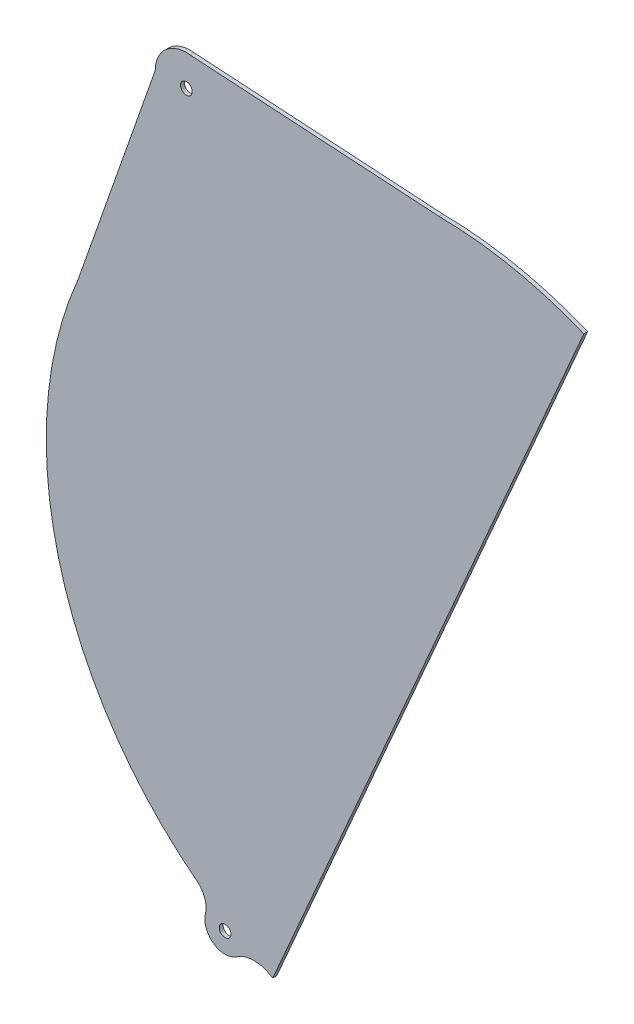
ISO-10303-21;
HEADER;
FILE_DESCRIPTION(('STEP AP214'),'2;1');
FILE_NAME('part.step','',(''),(''),'','','');
FILE_SCHEMA(('AUTOMOTIVE_DESIGN { 1 0 10303 214 1 1 1 1 }'));
ENDSEC;
DATA;
#1=APPLICATION_CONTEXT('core data for automotive mechanical design processes');
#2=APPLICATION_PROTOCOL_DEFINITION('international standard','automotive_design',2000,#1);
#3=PRODUCT_CONTEXT('',#1,'mechanical');
#4=PRODUCT('Part','Part','',(#3));
#5=PRODUCT_RELATED_PRODUCT_CATEGORY('part','',(#4));
#6=PRODUCT_DEFINITION_FORMATION('','',#4);
#7=PRODUCT_DEFINITION_CONTEXT('part definition',#1,'design');
#8=PRODUCT_DEFINITION('design','',#6,#7);
#9=PRODUCT_DEFINITION_SHAPE('','',#8);
#10=(LENGTH_UNIT() NAMED_UNIT(*) SI_UNIT(.MILLI.,.METRE.));
#11=(NAMED_UNIT(*) PLANE_ANGLE_UNIT() SI_UNIT($,.RADIAN.));
#12=(NAMED_UNIT(*) SI_UNIT($,.STERADIAN.) SOLID_ANGLE_UNIT());
#13=UNCERTAINTY_MEASURE_WITH_UNIT(LENGTH_MEASURE(1.E-05),#10,'distance_accuracy_value','');
#14=(GEOMETRIC_REPRESENTATION_CONTEXT(3) GLOBAL_UNCERTAINTY_ASSIGNED_CONTEXT((#13)) GLOBAL_UNIT_ASSIGNED_CONTEXT((#10,
#11,#12)) REPRESENTATION_CONTEXT('',''));
#15=CARTESIAN_POINT('',(0.,0.,0.));
#16=DIRECTION('',(0.,0.,1.));
#17=DIRECTION('',(1.,0.,0.));
#18=AXIS2_PLACEMENT_3D('',#15,#16,#17);
#19=CARTESIAN_POINT('',(0.,0.,3.175));
#20=DIRECTION('',(0.,0.,1.));
#21=DIRECTION('',(1.,0.,0.));
#22=AXIS2_PLACEMENT_3D('',#19,#20,#21);
#23=PLANE('',#22);
#24=CARTESIAN_POINT('',(-203.2,304.8,3.175));
#25=DIRECTION('',(0.,0.,1.));
#26=DIRECTION('',(1.,0.,0.));
#27=AXIS2_PLACEMENT_3D('',#24,#25,#26);
#28=CIRCLE('',#27,4.76250000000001);
#29=CARTESIAN_POINT('',(-198.4375,304.8,3.175));
#30=VERTEX_POINT('',#29);
#31=EDGE_CURVE('E238',#30,#30,#28,.T.);
#32=ORIENTED_EDGE('',*,*,#31,.F.);
#33=EDGE_LOOP('',(#32));
#34=FACE_BOUND('',#33,.T.);
#35=CARTESIAN_POINT('',(-171.614353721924,-274.640375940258,3.175));
#36=DIRECTION('',(0.,0.,1.));
#37=DIRECTION('',(1.,0.,0.));
#38=AXIS2_PLACEMENT_3D('',#35,#36,#37);
#39=CIRCLE('',#38,4.76250000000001);
#40=CARTESIAN_POINT('',(-166.851853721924,-274.640375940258,3.175));
#41=VERTEX_POINT('',#40);
#42=EDGE_CURVE('E168',#41,#41,#39,.T.);
#43=ORIENTED_EDGE('',*,*,#42,.F.);
#44=EDGE_LOOP('',(#43));
#45=FACE_BOUND('',#44,.T.);
#46=CARTESIAN_POINT('',(0.,0.,3.175));
#47=DIRECTION('',(0.,0.,1.));
#48=DIRECTION('',(1.,0.,0.));
#49=AXIS2_PLACEMENT_3D('',#46,#47,#48);
#50=CIRCLE('',#49,317.5);
#51=CARTESIAN_POINT('',(-134.867290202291,-287.431842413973,3.175));
#52=VERTEX_POINT('',#51);
#53=CARTESIAN_POINT('',(-132.685161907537,-288.445658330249,3.175));
#54=VERTEX_POINT('',#53);
#55=EDGE_CURVE('E157',#52,#54,#50,.T.);
#56=ORIENTED_EDGE('',*,*,#55,.T.);
#57=DIRECTION('',(-0.399652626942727,-0.916666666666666,0.));
#58=VECTOR('',#57,1.);
#59=CARTESIAN_POINT('',(121.068875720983,293.579460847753,3.175));
#60=LINE('',#59,#58);
#61=CARTESIAN_POINT('',(121.04349524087,293.521246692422,3.175));
#62=VERTEX_POINT('',#61);
#63=EDGE_CURVE('E56',#62,#54,#60,.T.);
#64=ORIENTED_EDGE('',*,*,#63,.F.);
#65=CARTESIAN_POINT('',(0.,0.,3.175));
#66=DIRECTION('',(0.,0.,1.));
#67=DIRECTION('',(1.,0.,0.));
#68=AXIS2_PLACEMENT_3D('',#65,#66,#67);
#69=CIRCLE('',#68,317.5);
#70=CARTESIAN_POINT('',(2.99071399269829,317.485914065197,3.175));
#71=VERTEX_POINT('',#70);
#72=EDGE_CURVE('E111',#62,#71,#69,.T.);
#73=ORIENTED_EDGE('',*,*,#72,.T.);
#74=DIRECTION('',(-0.99810431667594,0.0615448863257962,0.));
#75=VECTOR('',#74,1.);
#76=CARTESIAN_POINT('',(-200.079446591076,330.007581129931,3.175));
#77=LINE('',#76,#75);
#78=CARTESIAN_POINT('',(-200.079446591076,330.007581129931,3.175));
#79=VERTEX_POINT('',#78);
#80=EDGE_CURVE('E208',#71,#79,#77,.T.);
#81=ORIENTED_EDGE('',*,*,#80,.T.);
#82=CARTESIAN_POINT('',(-203.2,304.8,3.175));
#83=DIRECTION('',(0.,0.,1.));
#84=DIRECTION('',(1.,0.,0.));
#85=AXIS2_PLACEMENT_3D('',#82,#83,#84);
#86=CIRCLE('',#85,25.4);
#87=CARTESIAN_POINT('',(-228.6,304.8,3.175));
#88=VERTEX_POINT('',#87);
#89=EDGE_CURVE('E227',#79,#88,#86,.T.);
#90=ORIENTED_EDGE('',*,*,#89,.T.);
#91=DIRECTION('',(-0.331375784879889,-0.943498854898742,0.));
#92=VECTOR('',#91,1.);
#93=CARTESIAN_POINT('',(-228.6,304.8,3.175));
#94=LINE('',#93,#92);
#95=CARTESIAN_POINT('',(-291.270360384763,126.363868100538,3.175));
#96=VERTEX_POINT('',#95);
#97=EDGE_CURVE('E226',#88,#96,#94,.T.);
#98=ORIENTED_EDGE('',*,*,#97,.T.);
#99=CARTESIAN_POINT('',(0.,0.,3.175));
#100=DIRECTION('',(0.,0.,1.));
#101=DIRECTION('',(1.,0.,0.));
#102=AXIS2_PLACEMENT_3D('',#99,#100,#101);
#103=CIRCLE('',#102,317.5);
#104=CARTESIAN_POINT('',(-194.071360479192,-251.281827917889,3.175));
#105=VERTEX_POINT('',#104);
#106=EDGE_CURVE('E135',#96,#105,#103,.T.);
#107=ORIENTED_EDGE('',*,*,#106,.T.);
#108=CARTESIAN_POINT('',(-206.792280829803,-266.261237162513,3.175));
#109=DIRECTION('',(0.,0.,-1.));
#110=DIRECTION('',(1.,0.,0.));
#111=AXIS2_PLACEMENT_3D('',#108,#109,#110);
#112=CIRCLE('',#111,19.6520868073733);
#113=CARTESIAN_POINT('',(-187.675030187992,-270.81483395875,3.175));
#114=VERTEX_POINT('',#113);
#115=EDGE_CURVE('E129',#105,#114,#112,.T.);
#116=ORIENTED_EDGE('',*,*,#115,.T.);
#117=CARTESIAN_POINT('',(-171.614353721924,-274.640375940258,3.175));
#118=DIRECTION('',(0.,0.,1.));
#119=DIRECTION('',(1.,0.,0.));
#120=AXIS2_PLACEMENT_3D('',#117,#118,#119);
#121=CIRCLE('',#120,16.51);
#122=CARTESIAN_POINT('',(-162.24085756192,-288.231463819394,3.175));
#123=VERTEX_POINT('',#122);
#124=EDGE_CURVE('E132',#114,#123,#121,.T.);
#125=ORIENTED_EDGE('',*,*,#124,.T.);
#126=CARTESIAN_POINT('',(-147.936533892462,-308.971998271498,3.175));
#127=DIRECTION('',(0.,0.,-1.));
#128=DIRECTION('',(1.,0.,0.));
#129=AXIS2_PLACEMENT_3D('',#126,#127,#128);
#130=CIRCLE('',#129,25.1949091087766);
#131=EDGE_CURVE('E66',#123,#52,#130,.T.);
#132=ORIENTED_EDGE('',*,*,#131,.T.);
#133=EDGE_LOOP('',(#56,#64,#73,#81,#90,#98,#107,#116,#125,#132));
#134=FACE_BOUND('',#133,.T.);
#135=ADVANCED_FACE('F38',(#34,#45,#134),#23,.T.);
#136=CARTESIAN_POINT('',(0.,0.,0.));
#137=DIRECTION('',(0.,0.,1.));
#138=DIRECTION('',(1.,0.,0.));
#139=AXIS2_PLACEMENT_3D('',#136,#137,#138);
#140=PLANE('',#139);
#141=CARTESIAN_POINT('',(-203.2,304.8,0.));
#142=DIRECTION('',(0.,0.,1.));
#143=DIRECTION('',(1.,0.,0.));
#144=AXIS2_PLACEMENT_3D('',#141,#142,#143);
#145=CIRCLE('',#144,4.76250000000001);
#146=CARTESIAN_POINT('',(-198.4375,304.8,0.));
#147=VERTEX_POINT('',#146);
#148=EDGE_CURVE('E242',#147,#147,#145,.T.);
#149=ORIENTED_EDGE('',*,*,#148,.T.);
#150=EDGE_LOOP('',(#149));
#151=FACE_BOUND('',#150,.T.);
#152=CARTESIAN_POINT('',(-171.614353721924,-274.640375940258,0.));
#153=DIRECTION('',(0.,0.,1.));
#154=DIRECTION('',(1.,0.,0.));
#155=AXIS2_PLACEMENT_3D('',#152,#153,#154);
#156=CIRCLE('',#155,4.76250000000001);
#157=CARTESIAN_POINT('',(-166.851853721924,-274.640375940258,0.));
#158=VERTEX_POINT('',#157);
#159=EDGE_CURVE('E235',#158,#158,#156,.T.);
#160=ORIENTED_EDGE('',*,*,#159,.T.);
#161=EDGE_LOOP('',(#160));
#162=FACE_BOUND('',#161,.T.);
#163=DIRECTION('',(0.399652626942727,0.916666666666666,0.));
#164=VECTOR('',#163,1.);
#165=CARTESIAN_POINT('',(121.068875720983,293.579460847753,0.));
#166=LINE('',#165,#164);
#167=CARTESIAN_POINT('',(-132.685161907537,-288.445658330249,0.));
#168=VERTEX_POINT('',#167);
#169=CARTESIAN_POINT('',(121.04349524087,293.521246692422,0.));
#170=VERTEX_POINT('',#169);
#171=EDGE_CURVE('E250',#168,#170,#166,.T.);
#172=ORIENTED_EDGE('',*,*,#171,.F.);
#173=CARTESIAN_POINT('',(0.,0.,0.));
#174=DIRECTION('',(0.,0.,1.));
#175=DIRECTION('',(1.,0.,0.));
#176=AXIS2_PLACEMENT_3D('',#173,#174,#175);
#177=CIRCLE('',#176,317.5);
#178=CARTESIAN_POINT('',(-134.867290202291,-287.431842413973,0.));
#179=VERTEX_POINT('',#178);
#180=EDGE_CURVE('E184',#179,#168,#177,.T.);
#181=ORIENTED_EDGE('',*,*,#180,.F.);
#182=CARTESIAN_POINT('',(-147.936533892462,-308.971998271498,0.));
#183=DIRECTION('',(0.,0.,-1.));
#184=DIRECTION('',(1.,0.,0.));
#185=AXIS2_PLACEMENT_3D('',#182,#183,#184);
#186=CIRCLE('',#185,25.1949091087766);
#187=CARTESIAN_POINT('',(-162.24085756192,-288.231463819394,0.));
#188=VERTEX_POINT('',#187);
#189=EDGE_CURVE('E104',#188,#179,#186,.T.);
#190=ORIENTED_EDGE('',*,*,#189,.F.);
#191=CARTESIAN_POINT('',(-171.614353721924,-274.640375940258,0.));
#192=DIRECTION('',(0.,0.,1.));
#193=DIRECTION('',(1.,0.,0.));
#194=AXIS2_PLACEMENT_3D('',#191,#192,#193);
#195=CIRCLE('',#194,16.51);
#196=CARTESIAN_POINT('',(-187.675030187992,-270.81483395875,0.));
#197=VERTEX_POINT('',#196);
#198=EDGE_CURVE('E179',#197,#188,#195,.T.);
#199=ORIENTED_EDGE('',*,*,#198,.F.);
#200=CARTESIAN_POINT('',(-206.792280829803,-266.261237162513,0.));
#201=DIRECTION('',(0.,0.,-1.));
#202=DIRECTION('',(1.,0.,0.));
#203=AXIS2_PLACEMENT_3D('',#200,#201,#202);
#204=CIRCLE('',#203,19.6520868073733);
#205=CARTESIAN_POINT('',(-194.071360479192,-251.281827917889,0.));
#206=VERTEX_POINT('',#205);
#207=EDGE_CURVE('E145',#206,#197,#204,.T.);
#208=ORIENTED_EDGE('',*,*,#207,.F.);
#209=CARTESIAN_POINT('',(0.,0.,0.));
#210=DIRECTION('',(0.,0.,1.));
#211=DIRECTION('',(1.,0.,0.));
#212=AXIS2_PLACEMENT_3D('',#209,#210,#211);
#213=CIRCLE('',#212,317.5);
#214=CARTESIAN_POINT('',(-291.270360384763,126.363868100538,0.));
#215=VERTEX_POINT('',#214);
#216=EDGE_CURVE('E174',#215,#206,#213,.T.);
#217=ORIENTED_EDGE('',*,*,#216,.F.);
#218=DIRECTION('',(-0.331375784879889,-0.943498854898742,0.));
#219=VECTOR('',#218,1.);
#220=CARTESIAN_POINT('',(-228.6,304.8,0.));
#221=LINE('',#220,#219);
#222=CARTESIAN_POINT('',(-228.6,304.8,0.));
#223=VERTEX_POINT('',#222);
#224=EDGE_CURVE('E172',#223,#215,#221,.T.);
#225=ORIENTED_EDGE('',*,*,#224,.F.);
#226=CARTESIAN_POINT('',(-203.2,304.8,0.));
#227=DIRECTION('',(0.,0.,1.));
#228=DIRECTION('',(1.,0.,0.));
#229=AXIS2_PLACEMENT_3D('',#226,#227,#228);
#230=CIRCLE('',#229,25.4);
#231=CARTESIAN_POINT('',(-200.079446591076,330.007581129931,0.));
#232=VERTEX_POINT('',#231);
#233=EDGE_CURVE('E170',#232,#223,#230,.T.);
#234=ORIENTED_EDGE('',*,*,#233,.F.);
#235=DIRECTION('',(-0.99810431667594,0.0615448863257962,0.));
#236=VECTOR('',#235,1.);
#237=CARTESIAN_POINT('',(-200.079446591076,330.007581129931,0.));
#238=LINE('',#237,#236);
#239=CARTESIAN_POINT('',(2.99071399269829,317.485914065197,0.));
#240=VERTEX_POINT('',#239);
#241=EDGE_CURVE('E167',#240,#232,#238,.T.);
#242=ORIENTED_EDGE('',*,*,#241,.F.);
#243=CARTESIAN_POINT('',(0.,0.,0.));
#244=DIRECTION('',(0.,0.,1.));
#245=DIRECTION('',(1.,0.,0.));
#246=AXIS2_PLACEMENT_3D('',#243,#244,#245);
#247=CIRCLE('',#246,317.5);
#248=EDGE_CURVE('E164',#170,#240,#247,.T.);
#249=ORIENTED_EDGE('',*,*,#248,.F.);
#250=EDGE_LOOP('',(#172,#181,#190,#199,#208,#217,#225,#234,#242,#249));
#251=FACE_BOUND('',#250,.T.);
#252=ADVANCED_FACE('F214',(#151,#162,#251),#140,.F.);
#253=CARTESIAN_POINT('',(0.,0.,3.175));
#254=DIRECTION('',(0.,0.,-1.));
#255=DIRECTION('',(-1.,0.,0.));
#256=AXIS2_PLACEMENT_3D('',#253,#254,#255);
#257=CYLINDRICAL_SURFACE('',#256,317.5);
#258=DIRECTION('',(0.,0.,-1.));
#259=VECTOR('',#258,1.);
#260=CARTESIAN_POINT('',(121.04349524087,293.521246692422,3.175));
#261=LINE('',#260,#259);
#262=EDGE_CURVE('E245',#170,#62,#261,.F.);
#263=ORIENTED_EDGE('',*,*,#262,.F.);
#264=ORIENTED_EDGE('',*,*,#248,.T.);
#265=DIRECTION('',(0.,0.,-1.));
#266=VECTOR('',#265,1.);
#267=CARTESIAN_POINT('',(2.99071399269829,317.485914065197,3.175));
#268=LINE('',#267,#266);
#269=EDGE_CURVE('E47',#71,#240,#268,.T.);
#270=ORIENTED_EDGE('',*,*,#269,.F.);
#271=ORIENTED_EDGE('',*,*,#72,.F.);
#272=EDGE_LOOP('',(#263,#264,#270,#271));
#273=FACE_BOUND('',#272,.T.);
#274=ADVANCED_FACE('F40',(#273),#257,.T.);
#275=CARTESIAN_POINT('',(0.,0.,3.175));
#276=DIRECTION('',(0.,0.,-1.));
#277=DIRECTION('',(-1.,0.,0.));
#278=AXIS2_PLACEMENT_3D('',#275,#276,#277);
#279=CYLINDRICAL_SURFACE('',#278,317.5);
#280=DIRECTION('',(0.,0.,-1.));
#281=VECTOR('',#280,1.);
#282=CARTESIAN_POINT('',(-132.685161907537,-288.445658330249,3.175));
#283=LINE('',#282,#281);
#284=EDGE_CURVE('E11',#54,#168,#283,.T.);
#285=ORIENTED_EDGE('',*,*,#284,.F.);
#286=ORIENTED_EDGE('',*,*,#55,.F.);
#287=DIRECTION('',(0.,0.,-1.));
#288=VECTOR('',#287,1.);
#289=CARTESIAN_POINT('',(-134.867290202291,-287.431842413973,3.175));
#290=LINE('',#289,#288);
#291=EDGE_CURVE('E163',#52,#179,#290,.T.);
#292=ORIENTED_EDGE('',*,*,#291,.T.);
#293=ORIENTED_EDGE('',*,*,#180,.T.);
#294=EDGE_LOOP('',(#285,#286,#292,#293));
#295=FACE_BOUND('',#294,.T.);
#296=ADVANCED_FACE('F261',(#295),#279,.T.);
#297=CARTESIAN_POINT('',(-200.079446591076,330.007581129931,3.175));
#298=DIRECTION('',(-0.0615448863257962,-0.99810431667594,0.));
#299=DIRECTION('',(0.99810431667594,-0.0615448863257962,0.));
#300=AXIS2_PLACEMENT_3D('',#297,#298,#299);
#301=PLANE('',#300);
#302=ORIENTED_EDGE('',*,*,#241,.T.);
#303=DIRECTION('',(0.,0.,-1.));
#304=VECTOR('',#303,1.);
#305=CARTESIAN_POINT('',(-200.079446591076,330.007581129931,3.175));
#306=LINE('',#305,#304);
#307=EDGE_CURVE('E200',#79,#232,#306,.T.);
#308=ORIENTED_EDGE('',*,*,#307,.F.);
#309=ORIENTED_EDGE('',*,*,#80,.F.);
#310=ORIENTED_EDGE('',*,*,#269,.T.);
#311=EDGE_LOOP('',(#302,#308,#309,#310));
#312=FACE_BOUND('',#311,.T.);
#313=ADVANCED_FACE('F206',(#312),#301,.F.);
#314=CARTESIAN_POINT('',(-203.2,304.8,3.175));
#315=DIRECTION('',(0.,0.,-1.));
#316=DIRECTION('',(-1.,0.,0.));
#317=AXIS2_PLACEMENT_3D('',#314,#315,#316);
#318=CYLINDRICAL_SURFACE('',#317,25.4);
#319=ORIENTED_EDGE('',*,*,#233,.T.);
#320=DIRECTION('',(0.,0.,-1.));
#321=VECTOR('',#320,1.);
#322=CARTESIAN_POINT('',(-228.6,304.8,3.175));
#323=LINE('',#322,#321);
#324=EDGE_CURVE('E197',#88,#223,#323,.T.);
#325=ORIENTED_EDGE('',*,*,#324,.F.);
#326=ORIENTED_EDGE('',*,*,#89,.F.);
#327=ORIENTED_EDGE('',*,*,#307,.T.);
#328=EDGE_LOOP('',(#319,#325,#326,#327));
#329=FACE_BOUND('',#328,.T.);
#330=ADVANCED_FACE('F220',(#329),#318,.T.);
#331=CARTESIAN_POINT('',(-228.6,304.8,3.175));
#332=DIRECTION('',(0.943498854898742,-0.331375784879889,0.));
#333=DIRECTION('',(0.331375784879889,0.943498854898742,0.));
#334=AXIS2_PLACEMENT_3D('',#331,#332,#333);
#335=PLANE('',#334);
#336=ORIENTED_EDGE('',*,*,#224,.T.);
#337=DIRECTION('',(0.,0.,-1.));
#338=VECTOR('',#337,1.);
#339=CARTESIAN_POINT('',(-291.270360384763,126.363868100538,3.175));
#340=LINE('',#339,#338);
#341=EDGE_CURVE('E194',#96,#215,#340,.T.);
#342=ORIENTED_EDGE('',*,*,#341,.F.);
#343=ORIENTED_EDGE('',*,*,#97,.F.);
#344=ORIENTED_EDGE('',*,*,#324,.T.);
#345=EDGE_LOOP('',(#336,#342,#343,#344));
#346=FACE_BOUND('',#345,.T.);
#347=ADVANCED_FACE('F224',(#346),#335,.F.);
#348=CARTESIAN_POINT('',(0.,0.,3.175));
#349=DIRECTION('',(0.,0.,-1.));
#350=DIRECTION('',(-1.,0.,0.));
#351=AXIS2_PLACEMENT_3D('',#348,#349,#350);
#352=CYLINDRICAL_SURFACE('',#351,317.5);
#353=ORIENTED_EDGE('',*,*,#216,.T.);
#354=DIRECTION('',(0.,0.,-1.));
#355=VECTOR('',#354,1.);
#356=CARTESIAN_POINT('',(-194.071360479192,-251.281827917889,3.175));
#357=LINE('',#356,#355);
#358=EDGE_CURVE('E149',#105,#206,#357,.T.);
#359=ORIENTED_EDGE('',*,*,#358,.F.);
#360=ORIENTED_EDGE('',*,*,#106,.F.);
#361=ORIENTED_EDGE('',*,*,#341,.T.);
#362=EDGE_LOOP('',(#353,#359,#360,#361));
#363=FACE_BOUND('',#362,.T.);
#364=ADVANCED_FACE('F288',(#363),#352,.T.);
#365=CARTESIAN_POINT('',(-206.792280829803,-266.261237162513,3.175));
#366=DIRECTION('',(0.,0.,-1.));
#367=DIRECTION('',(-1.,0.,0.));
#368=AXIS2_PLACEMENT_3D('',#365,#366,#367);
#369=CYLINDRICAL_SURFACE('',#368,19.6520868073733);
#370=ORIENTED_EDGE('',*,*,#207,.T.);
#371=DIRECTION('',(0.,0.,-1.));
#372=VECTOR('',#371,1.);
#373=CARTESIAN_POINT('',(-187.675030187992,-270.81483395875,3.175));
#374=LINE('',#373,#372);
#375=EDGE_CURVE('E142',#114,#197,#374,.T.);
#376=ORIENTED_EDGE('',*,*,#375,.F.);
#377=ORIENTED_EDGE('',*,*,#115,.F.);
#378=ORIENTED_EDGE('',*,*,#358,.T.);
#379=EDGE_LOOP('',(#370,#376,#377,#378));
#380=FACE_BOUND('',#379,.T.);
#381=ADVANCED_FACE('F143',(#380),#369,.F.);
#382=CARTESIAN_POINT('',(-171.614353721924,-274.640375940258,3.175));
#383=DIRECTION('',(0.,0.,-1.));
#384=DIRECTION('',(-1.,0.,0.));
#385=AXIS2_PLACEMENT_3D('',#382,#383,#384);
#386=CYLINDRICAL_SURFACE('',#385,16.51);
#387=ORIENTED_EDGE('',*,*,#198,.T.);
#388=DIRECTION('',(0.,0.,-1.));
#389=VECTOR('',#388,1.);
#390=CARTESIAN_POINT('',(-162.24085756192,-288.231463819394,3.175));
#391=LINE('',#390,#389);
#392=EDGE_CURVE('E150',#123,#188,#391,.T.);
#393=ORIENTED_EDGE('',*,*,#392,.F.);
#394=ORIENTED_EDGE('',*,*,#124,.F.);
#395=ORIENTED_EDGE('',*,*,#375,.T.);
#396=EDGE_LOOP('',(#387,#393,#394,#395));
#397=FACE_BOUND('',#396,.T.);
#398=ADVANCED_FACE('F152',(#397),#386,.T.);
#399=CARTESIAN_POINT('',(-147.936533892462,-308.971998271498,3.175));
#400=DIRECTION('',(0.,0.,-1.));
#401=DIRECTION('',(-1.,0.,0.));
#402=AXIS2_PLACEMENT_3D('',#399,#400,#401);
#403=CYLINDRICAL_SURFACE('',#402,25.1949091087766);
#404=ORIENTED_EDGE('',*,*,#189,.T.);
#405=ORIENTED_EDGE('',*,*,#291,.F.);
#406=ORIENTED_EDGE('',*,*,#131,.F.);
#407=ORIENTED_EDGE('',*,*,#392,.T.);
#408=EDGE_LOOP('',(#404,#405,#406,#407));
#409=FACE_BOUND('',#408,.T.);
#410=ADVANCED_FACE('F281',(#409),#403,.F.);
#411=CARTESIAN_POINT('',(-171.614353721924,-274.640375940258,3.175));
#412=DIRECTION('',(0.,0.,-1.));
#413=DIRECTION('',(-1.,0.,0.));
#414=AXIS2_PLACEMENT_3D('',#411,#412,#413);
#415=CYLINDRICAL_SURFACE('',#414,4.76250000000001);
#416=ORIENTED_EDGE('',*,*,#42,.T.);
#417=EDGE_LOOP('',(#416));
#418=FACE_BOUND('',#417,.T.);
#419=ORIENTED_EDGE('',*,*,#159,.F.);
#420=EDGE_LOOP('',(#419));
#421=FACE_BOUND('',#420,.T.);
#422=ADVANCED_FACE('F278',(#418,#421),#415,.F.);
#423=CARTESIAN_POINT('',(-203.2,304.8,3.175));
#424=DIRECTION('',(0.,0.,-1.));
#425=DIRECTION('',(-1.,0.,0.));
#426=AXIS2_PLACEMENT_3D('',#423,#424,#425);
#427=CYLINDRICAL_SURFACE('',#426,4.76250000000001);
#428=ORIENTED_EDGE('',*,*,#31,.T.);
#429=EDGE_LOOP('',(#428));
#430=FACE_BOUND('',#429,.T.);
#431=ORIENTED_EDGE('',*,*,#148,.F.);
#432=EDGE_LOOP('',(#431));
#433=FACE_BOUND('',#432,.T.);
#434=ADVANCED_FACE('F330',(#430,#433),#427,.F.);
#435=CARTESIAN_POINT('',(-5.82083333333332,2.53779418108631,0.));
#436=DIRECTION('',(0.916666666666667,-0.399652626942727,0.));
#437=DIRECTION('',(0.399652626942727,0.916666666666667,0.));
#438=AXIS2_PLACEMENT_3D('',#435,#436,#437);
#439=PLANE('',#438);
#440=ORIENTED_EDGE('',*,*,#262,.T.);
#441=ORIENTED_EDGE('',*,*,#63,.T.);
#442=ORIENTED_EDGE('',*,*,#284,.T.);
#443=ORIENTED_EDGE('',*,*,#171,.T.);
#444=EDGE_LOOP('',(#440,#441,#442,#443));
#445=FACE_BOUND('',#444,.T.);
#446=ADVANCED_FACE('F256',(#445),#439,.T.);
#447=CLOSED_SHELL('',(#135,#252,#274,#296,#313,#330,#347,#364,#381,#398,#410,#422,#434,#446));
#448=MANIFOLD_SOLID_BREP('B2',#447);
#449=ADVANCED_BREP_SHAPE_REPRESENTATION('',(#18,#448),#14);
#450=SHAPE_DEFINITION_REPRESENTATION(#9,#449);
ENDSEC;
END-ISO-10303-21;
